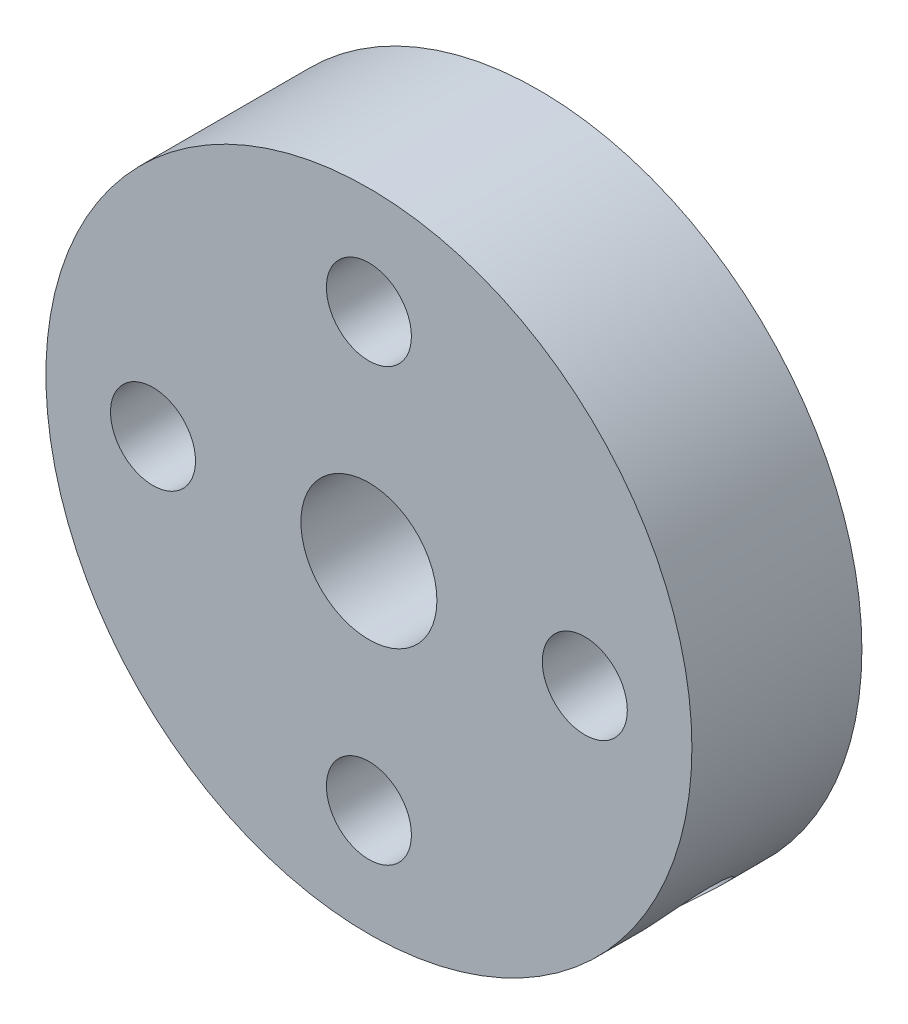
ISO-10303-21;
HEADER;
FILE_DESCRIPTION(('STEP AP214'),'2;1');
FILE_NAME('part.step','',(''),(''),'','','');
FILE_SCHEMA(('AUTOMOTIVE_DESIGN { 1 0 10303 214 1 1 1 1 }'));
ENDSEC;
DATA;
#1=APPLICATION_CONTEXT('core data for automotive mechanical design processes');
#2=APPLICATION_PROTOCOL_DEFINITION('international standard','automotive_design',2000,#1);
#3=PRODUCT_CONTEXT('',#1,'mechanical');
#4=PRODUCT('Part','Part','',(#3));
#5=PRODUCT_RELATED_PRODUCT_CATEGORY('part','',(#4));
#6=PRODUCT_DEFINITION_FORMATION('','',#4);
#7=PRODUCT_DEFINITION_CONTEXT('part definition',#1,'design');
#8=PRODUCT_DEFINITION('design','',#6,#7);
#9=PRODUCT_DEFINITION_SHAPE('','',#8);
#10=(LENGTH_UNIT() NAMED_UNIT(*) SI_UNIT(.MILLI.,.METRE.));
#11=(NAMED_UNIT(*) PLANE_ANGLE_UNIT() SI_UNIT($,.RADIAN.));
#12=(NAMED_UNIT(*) SI_UNIT($,.STERADIAN.) SOLID_ANGLE_UNIT());
#13=UNCERTAINTY_MEASURE_WITH_UNIT(LENGTH_MEASURE(1.E-05),#10,'distance_accuracy_value','');
#14=(GEOMETRIC_REPRESENTATION_CONTEXT(3) GLOBAL_UNCERTAINTY_ASSIGNED_CONTEXT((#13)) GLOBAL_UNIT_ASSIGNED_CONTEXT((#10,
#11,#12)) REPRESENTATION_CONTEXT('',''));
#15=CARTESIAN_POINT('',(0.,0.,0.));
#16=DIRECTION('',(0.,0.,1.));
#17=DIRECTION('',(1.,0.,0.));
#18=AXIS2_PLACEMENT_3D('',#15,#16,#17);
#19=CARTESIAN_POINT('',(0.,0.,5.));
#20=DIRECTION('',(0.,0.,-1.));
#21=DIRECTION('',(-1.,0.,0.));
#22=AXIS2_PLACEMENT_3D('',#19,#20,#21);
#23=CYLINDRICAL_SURFACE('',#22,9.5);
#24=CARTESIAN_POINT('',(7.54299377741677,-5.77522682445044,2.5));
#25=CARTESIAN_POINT('',(7.54299243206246,-5.77522965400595,2.43011379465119));
#26=CARTESIAN_POINT('',(7.53939153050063,-5.77994112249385,2.36018467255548));
#27=CARTESIAN_POINT('',(7.5250384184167,-5.79861450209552,2.22227477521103));
#28=CARTESIAN_POINT('',(7.51427885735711,-5.81258592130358,2.15429607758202));
#29=CARTESIAN_POINT('',(7.4857956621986,-5.84922201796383,2.02230357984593));
#30=CARTESIAN_POINT('',(7.46807690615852,-5.87188060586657,1.95828703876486));
#31=CARTESIAN_POINT('',(7.42598142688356,-5.92502688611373,1.83596492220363));
#32=CARTESIAN_POINT('',(7.40160578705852,-5.95551330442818,1.77765841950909));
#33=CARTESIAN_POINT('',(7.34647045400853,-6.02339512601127,1.66803949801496));
#34=CARTESIAN_POINT('',(7.31567621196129,-6.06082779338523,1.61676752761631));
#35=CARTESIAN_POINT('',(7.24836322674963,-6.14117020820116,1.52302277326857));
#36=CARTESIAN_POINT('',(7.21184419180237,-6.18408023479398,1.48055043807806));
#37=CARTESIAN_POINT('',(7.13368219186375,-6.27408466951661,1.40546437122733));
#38=CARTESIAN_POINT('',(7.09202090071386,-6.32119386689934,1.37288742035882));
#39=CARTESIAN_POINT('',(7.0046262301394,-6.41790106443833,1.31875255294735));
#40=CARTESIAN_POINT('',(6.95889301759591,-6.46749896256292,1.29719418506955));
#41=CARTESIAN_POINT('',(6.86477339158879,-6.56731009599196,1.265829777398));
#42=CARTESIAN_POINT('',(6.81640389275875,-6.61751809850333,1.25595634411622));
#43=CARTESIAN_POINT('',(6.71808236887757,-6.71731154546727,1.2480331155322));
#44=CARTESIAN_POINT('',(6.66813041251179,-6.76689701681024,1.24998280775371));
#45=CARTESIAN_POINT('',(6.56840652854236,-6.86373356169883,1.26559667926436));
#46=CARTESIAN_POINT('',(6.5186353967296,-6.91099717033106,1.27918837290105));
#47=CARTESIAN_POINT('',(6.42047178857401,-7.00228803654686,1.31758700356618));
#48=CARTESIAN_POINT('',(6.37207934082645,-7.04631522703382,1.3423941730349));
#49=CARTESIAN_POINT('',(6.27806077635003,-7.13021308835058,1.40259594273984));
#50=CARTESIAN_POINT('',(6.23244328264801,-7.17007105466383,1.43802170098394));
#51=CARTESIAN_POINT('',(6.14562599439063,-7.24462287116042,1.51843235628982));
#52=CARTESIAN_POINT('',(6.10442642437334,-7.27931645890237,1.56341773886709));
#53=CARTESIAN_POINT('',(6.02755543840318,-7.34309840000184,1.66207612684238));
#54=CARTESIAN_POINT('',(5.99192824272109,-7.37214232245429,1.7158123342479));
#55=CARTESIAN_POINT('',(5.9278600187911,-7.42375737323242,1.83023047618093));
#56=CARTESIAN_POINT('',(5.89941901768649,-7.44632847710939,1.89091243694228));
#57=CARTESIAN_POINT('',(5.85077620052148,-7.48460961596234,2.01755772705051));
#58=CARTESIAN_POINT('',(5.83057852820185,-7.50031620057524,2.0835236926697));
#59=CARTESIAN_POINT('',(5.79923340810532,-7.52457895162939,2.21883386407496));
#60=CARTESIAN_POINT('',(5.78808547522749,-7.53313550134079,2.28817788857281));
#61=CARTESIAN_POINT('',(5.77533482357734,-7.5429154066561,2.42772111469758));
#62=CARTESIAN_POINT('',(5.77366142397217,-7.54419306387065,2.49791005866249));
#63=CARTESIAN_POINT('',(5.77973733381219,-7.53953913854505,2.63763655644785));
#64=CARTESIAN_POINT('',(5.78748642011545,-7.53360772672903,2.70717412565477));
#65=CARTESIAN_POINT('',(5.81205053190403,-7.51467265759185,2.84335692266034));
#66=CARTESIAN_POINT('',(5.82883131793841,-7.50169570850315,2.91001205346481));
#67=CARTESIAN_POINT('',(5.87078766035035,-7.46890600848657,3.03884829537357));
#68=CARTESIAN_POINT('',(5.89596354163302,-7.44909299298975,3.10102923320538));
#69=CARTESIAN_POINT('',(5.95394173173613,-7.40283432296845,3.21955093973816));
#70=CARTESIAN_POINT('',(5.98678770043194,-7.37635062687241,3.27585549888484));
#71=CARTESIAN_POINT('',(6.05883931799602,-7.31728301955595,3.38065603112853));
#72=CARTESIAN_POINT('',(6.09804524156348,-7.28469884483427,3.42915166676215));
#73=CARTESIAN_POINT('',(6.18172359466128,-7.21382788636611,3.51726989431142));
#74=CARTESIAN_POINT('',(6.22622783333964,-7.17550626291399,3.55683429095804));
#75=CARTESIAN_POINT('',(6.31879476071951,-7.0941261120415,3.62556359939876));
#76=CARTESIAN_POINT('',(6.36685737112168,-7.05106768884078,3.65472873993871));
#77=CARTESIAN_POINT('',(6.46482442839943,-6.96135331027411,3.70173630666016));
#78=CARTESIAN_POINT('',(6.51472301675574,-6.91470835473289,3.71961191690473));
#79=CARTESIAN_POINT('',(6.61492982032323,-6.81890793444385,3.74364082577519));
#80=CARTESIAN_POINT('',(6.66523801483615,-6.76975259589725,3.74979471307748));
#81=CARTESIAN_POINT('',(6.76438593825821,-6.67067897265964,3.75019366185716));
#82=CARTESIAN_POINT('',(6.81323388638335,-6.62076925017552,3.7445282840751));
#83=CARTESIAN_POINT('',(6.9085087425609,-6.52129220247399,3.72163976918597));
#84=CARTESIAN_POINT('',(6.95493565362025,-6.47172487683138,3.70441664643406));
#85=CARTESIAN_POINT('',(7.04417102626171,-6.3744812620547,3.65893059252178));
#86=CARTESIAN_POINT('',(7.08698104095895,-6.32680416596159,3.63067242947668));
#87=CARTESIAN_POINT('',(7.16802112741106,-6.234840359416,3.56392774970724));
#88=CARTESIAN_POINT('',(7.20625112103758,-6.1905537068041,3.52544105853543));
#89=CARTESIAN_POINT('',(7.27759335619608,-6.10652925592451,3.43900219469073));
#90=CARTESIAN_POINT('',(7.31066652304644,-6.06682672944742,3.39098348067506));
#91=CARTESIAN_POINT('',(7.37072691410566,-5.99371582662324,3.28698264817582));
#92=CARTESIAN_POINT('',(7.39771269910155,-5.96030893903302,3.23099865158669));
#93=CARTESIAN_POINT('',(7.44520215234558,-5.90088319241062,3.11237952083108));
#94=CARTESIAN_POINT('',(7.46567759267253,-5.87489655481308,3.04971695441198));
#95=CARTESIAN_POINT('',(7.49961241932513,-5.83151599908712,2.91974623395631));
#96=CARTESIAN_POINT('',(7.51307935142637,-5.8141128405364,2.85244316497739));
#97=CARTESIAN_POINT('',(7.52960566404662,-5.79268088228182,2.73733543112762));
#98=CARTESIAN_POINT('',(7.53462161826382,-5.78614791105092,2.69025340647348));
#99=CARTESIAN_POINT('',(7.54131611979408,-5.7774199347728,2.5954542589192));
#100=CARTESIAN_POINT('',(7.54299469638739,-5.77522489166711,2.54773714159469));
#101=CARTESIAN_POINT('',(7.54299377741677,-5.77522682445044,2.5));
#102=B_SPLINE_CURVE_WITH_KNOTS('',3,(#24,#25,#26,#27,#28,#29,#30,#31,#32,#33,#34,#35,#36,#37,
#38,#39,#40,#41,#42,#43,#44,#45,#46,#47,#48,#49,#50,#51,#52,#53,#54,#55,#56,#57,#58,#59,#60,#61,
#62,#63,#64,#65,#66,#67,#68,#69,#70,#71,#72,#73,#74,#75,#76,#77,#78,#79,#80,#81,#82,#83,#84,#85,
#86,#87,#88,#89,#90,#91,#92,#93,#94,#95,#96,#97,#98,#99,#100,#101),.UNSPECIFIED.,.T.,.F.,(4,2,2,
2,2,2,2,2,2,2,2,2,2,2,2,2,2,2,2,2,2,2,2,2,2,2,2,2,2,2,2,2,2,2,2,2,2,2,4),(0.,0.209484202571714,
0.419183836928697,0.628736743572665,0.83825556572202,1.04893269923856,1.25962057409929,
1.47108224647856,1.68253525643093,1.89276266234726,2.10298095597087,2.31189982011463,
2.52082301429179,2.73036535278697,2.93991833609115,3.15105801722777,3.36219849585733,
3.57344497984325,3.78468013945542,3.99433736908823,4.2039896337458,4.41285264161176,
4.62172373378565,4.83181406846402,5.04191347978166,5.25334471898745,5.46477130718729,
5.6755735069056,5.88636511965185,6.09556525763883,6.30476513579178,6.51387472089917,
6.7229878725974,6.93361567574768,7.14429322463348,7.35587216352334,7.56722283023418,
7.71031637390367,7.85340866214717),.UNSPECIFIED.);
#103=CARTESIAN_POINT('',(7.54299377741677,-5.77522682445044,2.5));
#104=VERTEX_POINT('',#103);
#105=EDGE_CURVE('E85',#104,#104,#102,.T.);
#106=ORIENTED_EDGE('',*,*,#105,.T.);
#107=EDGE_LOOP('',(#106));
#108=FACE_BOUND('',#107,.T.);
#109=CARTESIAN_POINT('',(0.,0.,5.));
#110=DIRECTION('',(0.,0.,1.));
#111=DIRECTION('',(1.,0.,0.));
#112=AXIS2_PLACEMENT_3D('',#109,#110,#111);
#113=CIRCLE('',#112,9.5);
#114=CARTESIAN_POINT('',(9.5,0.,5.));
#115=VERTEX_POINT('',#114);
#116=EDGE_CURVE('E10',#115,#115,#113,.T.);
#117=ORIENTED_EDGE('',*,*,#116,.F.);
#118=EDGE_LOOP('',(#117));
#119=FACE_BOUND('',#118,.T.);
#120=CARTESIAN_POINT('',(0.,0.,0.));
#121=DIRECTION('',(0.,0.,1.));
#122=DIRECTION('',(1.,0.,0.));
#123=AXIS2_PLACEMENT_3D('',#120,#121,#122);
#124=CIRCLE('',#123,9.5);
#125=CARTESIAN_POINT('',(9.5,0.,0.));
#126=VERTEX_POINT('',#125);
#127=EDGE_CURVE('E47',#126,#126,#124,.T.);
#128=ORIENTED_EDGE('',*,*,#127,.T.);
#129=EDGE_LOOP('',(#128));
#130=FACE_BOUND('',#129,.T.);
#131=ADVANCED_FACE('F43',(#108,#119,#130),#23,.T.);
#132=CARTESIAN_POINT('',(0.,0.,5.));
#133=DIRECTION('',(0.,0.,1.));
#134=DIRECTION('',(1.,0.,0.));
#135=AXIS2_PLACEMENT_3D('',#132,#133,#134);
#136=PLANE('',#135);
#137=CARTESIAN_POINT('',(6.35,0.,5.));
#138=DIRECTION('',(0.,0.,1.));
#139=DIRECTION('',(1.,0.,0.));
#140=AXIS2_PLACEMENT_3D('',#137,#138,#139);
#141=CIRCLE('',#140,1.25);
#142=CARTESIAN_POINT('',(7.6,0.,5.));
#143=VERTEX_POINT('',#142);
#144=EDGE_CURVE('E82',#143,#143,#141,.T.);
#145=ORIENTED_EDGE('',*,*,#144,.F.);
#146=EDGE_LOOP('',(#145));
#147=FACE_BOUND('',#146,.T.);
#148=CARTESIAN_POINT('',(0.,-6.35,5.));
#149=DIRECTION('',(0.,0.,1.));
#150=DIRECTION('',(1.,0.,0.));
#151=AXIS2_PLACEMENT_3D('',#148,#149,#150);
#152=CIRCLE('',#151,1.25);
#153=CARTESIAN_POINT('',(1.25,-6.35,5.));
#154=VERTEX_POINT('',#153);
#155=EDGE_CURVE('E76',#154,#154,#152,.T.);
#156=ORIENTED_EDGE('',*,*,#155,.F.);
#157=EDGE_LOOP('',(#156));
#158=FACE_BOUND('',#157,.T.);
#159=CARTESIAN_POINT('',(-6.35,0.,5.));
#160=DIRECTION('',(0.,0.,1.));
#161=DIRECTION('',(1.,0.,0.));
#162=AXIS2_PLACEMENT_3D('',#159,#160,#161);
#163=CIRCLE('',#162,1.25);
#164=CARTESIAN_POINT('',(-5.1,0.,5.));
#165=VERTEX_POINT('',#164);
#166=EDGE_CURVE('E70',#165,#165,#163,.T.);
#167=ORIENTED_EDGE('',*,*,#166,.F.);
#168=EDGE_LOOP('',(#167));
#169=FACE_BOUND('',#168,.T.);
#170=CARTESIAN_POINT('',(0.,6.35,5.));
#171=DIRECTION('',(0.,0.,1.));
#172=DIRECTION('',(1.,0.,0.));
#173=AXIS2_PLACEMENT_3D('',#170,#171,#172);
#174=CIRCLE('',#173,1.25);
#175=CARTESIAN_POINT('',(1.25,6.35,5.));
#176=VERTEX_POINT('',#175);
#177=EDGE_CURVE('E64',#176,#176,#174,.T.);
#178=ORIENTED_EDGE('',*,*,#177,.F.);
#179=EDGE_LOOP('',(#178));
#180=FACE_BOUND('',#179,.T.);
#181=CARTESIAN_POINT('',(0.,0.,5.));
#182=DIRECTION('',(0.,0.,1.));
#183=DIRECTION('',(1.,0.,0.));
#184=AXIS2_PLACEMENT_3D('',#181,#182,#183);
#185=CIRCLE('',#184,2.);
#186=CARTESIAN_POINT('',(2.,0.,5.));
#187=VERTEX_POINT('',#186);
#188=EDGE_CURVE('E58',#187,#187,#185,.T.);
#189=ORIENTED_EDGE('',*,*,#188,.F.);
#190=EDGE_LOOP('',(#189));
#191=FACE_BOUND('',#190,.T.);
#192=ORIENTED_EDGE('',*,*,#116,.T.);
#193=EDGE_LOOP('',(#192));
#194=FACE_BOUND('',#193,.T.);
#195=ADVANCED_FACE('F125',(#147,#158,#169,#180,#191,#194),#136,.T.);
#196=CARTESIAN_POINT('',(0.,0.,0.));
#197=DIRECTION('',(0.,0.,1.));
#198=DIRECTION('',(1.,0.,0.));
#199=AXIS2_PLACEMENT_3D('',#196,#197,#198);
#200=PLANE('',#199);
#201=CARTESIAN_POINT('',(6.35,0.,0.));
#202=DIRECTION('',(0.,0.,1.));
#203=DIRECTION('',(1.,0.,0.));
#204=AXIS2_PLACEMENT_3D('',#201,#202,#203);
#205=CIRCLE('',#204,1.25);
#206=CARTESIAN_POINT('',(7.6,0.,0.));
#207=VERTEX_POINT('',#206);
#208=EDGE_CURVE('E79',#207,#207,#205,.T.);
#209=ORIENTED_EDGE('',*,*,#208,.T.);
#210=EDGE_LOOP('',(#209));
#211=FACE_BOUND('',#210,.T.);
#212=CARTESIAN_POINT('',(0.,-6.35,0.));
#213=DIRECTION('',(0.,0.,1.));
#214=DIRECTION('',(1.,0.,0.));
#215=AXIS2_PLACEMENT_3D('',#212,#213,#214);
#216=CIRCLE('',#215,1.25);
#217=CARTESIAN_POINT('',(1.25,-6.35,0.));
#218=VERTEX_POINT('',#217);
#219=EDGE_CURVE('E73',#218,#218,#216,.T.);
#220=ORIENTED_EDGE('',*,*,#219,.T.);
#221=EDGE_LOOP('',(#220));
#222=FACE_BOUND('',#221,.T.);
#223=CARTESIAN_POINT('',(-6.35,0.,0.));
#224=DIRECTION('',(0.,0.,1.));
#225=DIRECTION('',(1.,0.,0.));
#226=AXIS2_PLACEMENT_3D('',#223,#224,#225);
#227=CIRCLE('',#226,1.25);
#228=CARTESIAN_POINT('',(-5.1,0.,0.));
#229=VERTEX_POINT('',#228);
#230=EDGE_CURVE('E67',#229,#229,#227,.T.);
#231=ORIENTED_EDGE('',*,*,#230,.T.);
#232=EDGE_LOOP('',(#231));
#233=FACE_BOUND('',#232,.T.);
#234=CARTESIAN_POINT('',(0.,6.35,0.));
#235=DIRECTION('',(0.,0.,1.));
#236=DIRECTION('',(1.,0.,0.));
#237=AXIS2_PLACEMENT_3D('',#234,#235,#236);
#238=CIRCLE('',#237,1.25);
#239=CARTESIAN_POINT('',(1.25,6.35,0.));
#240=VERTEX_POINT('',#239);
#241=EDGE_CURVE('E61',#240,#240,#238,.T.);
#242=ORIENTED_EDGE('',*,*,#241,.T.);
#243=EDGE_LOOP('',(#242));
#244=FACE_BOUND('',#243,.T.);
#245=CARTESIAN_POINT('',(0.,0.,0.));
#246=DIRECTION('',(0.,0.,1.));
#247=DIRECTION('',(1.,0.,0.));
#248=AXIS2_PLACEMENT_3D('',#245,#246,#247);
#249=CIRCLE('',#248,2.);
#250=CARTESIAN_POINT('',(2.,0.,0.));
#251=VERTEX_POINT('',#250);
#252=EDGE_CURVE('E54',#251,#251,#249,.T.);
#253=ORIENTED_EDGE('',*,*,#252,.T.);
#254=EDGE_LOOP('',(#253));
#255=FACE_BOUND('',#254,.T.);
#256=ORIENTED_EDGE('',*,*,#127,.F.);
#257=EDGE_LOOP('',(#256));
#258=FACE_BOUND('',#257,.T.);
#259=ADVANCED_FACE('F123',(#211,#222,#233,#244,#255,#258),#200,.F.);
#260=CARTESIAN_POINT('',(0.,0.,5.));
#261=DIRECTION('',(0.,0.,1.));
#262=DIRECTION('',(1.,0.,0.));
#263=AXIS2_PLACEMENT_3D('',#260,#261,#262);
#264=CYLINDRICAL_SURFACE('',#263,2.);
#265=CARTESIAN_POINT('',(1.98785358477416,-0.22008663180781,2.5));
#266=CARTESIAN_POINT('',(1.98785579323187,-0.220096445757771,2.56212028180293));
#267=CARTESIAN_POINT('',(1.9872199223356,-0.226061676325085,2.62433783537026));
#268=CARTESIAN_POINT('',(1.98444333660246,-0.249218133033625,2.74667632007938));
#269=CARTESIAN_POINT('',(1.98229853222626,-0.266439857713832,2.80679108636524));
#270=CARTESIAN_POINT('',(1.97592617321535,-0.310151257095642,2.92278232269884));
#271=CARTESIAN_POINT('',(1.97171656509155,-0.336560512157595,2.97869060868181));
#272=CARTESIAN_POINT('',(1.96048817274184,-0.396764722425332,3.08600886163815));
#273=CARTESIAN_POINT('',(1.95346931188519,-0.430559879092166,3.1374187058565));
#274=CARTESIAN_POINT('',(1.93466925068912,-0.508803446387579,3.24186515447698));
#275=CARTESIAN_POINT('',(1.92237548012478,-0.554072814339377,3.29419474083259));
#276=CARTESIAN_POINT('',(1.89210239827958,-0.649986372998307,3.39188269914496));
#277=CARTESIAN_POINT('',(1.87411817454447,-0.700635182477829,3.43723499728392));
#278=CARTESIAN_POINT('',(1.82891839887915,-0.811834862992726,3.52510358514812));
#279=CARTESIAN_POINT('',(1.80085091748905,-0.872843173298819,3.5666176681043));
#280=CARTESIAN_POINT('',(1.73540719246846,-0.996616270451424,3.63812520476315));
#281=CARTESIAN_POINT('',(1.69804022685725,-1.05937925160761,3.66813006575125));
#282=CARTESIAN_POINT('',(1.61819639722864,-1.17727730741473,3.71248231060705));
#283=CARTESIAN_POINT('',(1.57662528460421,-1.2325391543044,3.72811141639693));
#284=CARTESIAN_POINT('',(1.48677017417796,-1.33954332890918,3.74763206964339));
#285=CARTESIAN_POINT('',(1.43849328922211,-1.39128930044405,3.75153595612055));
#286=CARTESIAN_POINT('',(1.3438304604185,-1.48251648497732,3.74764431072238));
#287=CARTESIAN_POINT('',(1.29806029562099,-1.52271168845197,3.74134862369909));
#288=CARTESIAN_POINT('',(1.2043061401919,-1.59789117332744,3.72013301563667));
#289=CARTESIAN_POINT('',(1.15632198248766,-1.63287506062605,3.70521244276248));
#290=CARTESIAN_POINT('',(1.05959400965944,-1.69724751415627,3.66739622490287));
#291=CARTESIAN_POINT('',(1.01084855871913,-1.72662146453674,3.6444801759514));
#292=CARTESIAN_POINT('',(0.914173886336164,-1.77969976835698,3.59153124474));
#293=CARTESIAN_POINT('',(0.866244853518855,-1.80340282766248,3.56149674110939));
#294=CARTESIAN_POINT('',(0.76665841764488,-1.8481266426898,3.49097183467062));
#295=CARTESIAN_POINT('',(0.715279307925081,-1.86844650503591,3.44964537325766));
#296=CARTESIAN_POINT('',(0.616848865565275,-1.90321553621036,3.35986761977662));
#297=CARTESIAN_POINT('',(0.569803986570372,-1.91765605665,3.31140597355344));
#298=CARTESIAN_POINT('',(0.476137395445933,-1.94317814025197,3.20129437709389));
#299=CARTESIAN_POINT('',(0.430373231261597,-1.95357479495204,3.13874861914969));
#300=CARTESIAN_POINT('',(0.349932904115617,-1.96957729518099,3.00635388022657));
#301=CARTESIAN_POINT('',(0.31523633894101,-1.9751919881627,2.93651865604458));
#302=CARTESIAN_POINT('',(0.267804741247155,-1.98209415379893,2.81023059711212));
#303=CARTESIAN_POINT('',(0.251693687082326,-1.98413134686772,2.75508903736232));
#304=CARTESIAN_POINT('',(0.228883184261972,-1.98689444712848,2.64288481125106));
#305=CARTESIAN_POINT('',(0.222170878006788,-1.98762214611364,2.5858248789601));
#306=CARTESIAN_POINT('',(0.218832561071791,-1.98799302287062,2.47127131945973));
#307=CARTESIAN_POINT('',(0.222229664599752,-1.98763371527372,2.41377699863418));
#308=CARTESIAN_POINT('',(0.238792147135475,-1.9857098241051,2.3002194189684));
#309=CARTESIAN_POINT('',(0.2519656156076,-1.98414424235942,2.24415738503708));
#310=CARTESIAN_POINT('',(0.286555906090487,-1.97943934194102,2.13578161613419));
#311=CARTESIAN_POINT('',(0.307833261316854,-1.97632639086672,2.08342132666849));
#312=CARTESIAN_POINT('',(0.357181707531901,-1.96800563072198,1.98221266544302));
#313=CARTESIAN_POINT('',(0.385255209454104,-1.96279707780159,1.9333655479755));
#314=CARTESIAN_POINT('',(0.452702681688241,-1.94845098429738,1.83069396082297));
#315=CARTESIAN_POINT('',(0.493210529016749,-1.93875420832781,1.77769245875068));
#316=CARTESIAN_POINT('',(0.580003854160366,-1.9145834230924,1.67781494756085));
#317=CARTESIAN_POINT('',(0.626295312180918,-1.90010444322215,1.63094538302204));
#318=CARTESIAN_POINT('',(0.730760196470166,-1.86266938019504,1.53701675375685));
#319=CARTESIAN_POINT('',(0.789648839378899,-1.83872653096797,1.49113144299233));
#320=CARTESIAN_POINT('',(0.910430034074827,-1.78200983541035,1.40993134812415));
#321=CARTESIAN_POINT('',(0.972321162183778,-1.74924014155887,1.37461161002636));
#322=CARTESIAN_POINT('',(1.09259782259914,-1.67656323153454,1.31800500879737));
#323=CARTESIAN_POINT('',(1.15097186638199,-1.63719945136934,1.29600579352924));
#324=CARTESIAN_POINT('',(1.26516188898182,-1.5506364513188,1.26427333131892));
#325=CARTESIAN_POINT('',(1.32098130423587,-1.50344817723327,1.25452311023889));
#326=CARTESIAN_POINT('',(1.41956348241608,-1.41023098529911,1.24845347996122));
#327=CARTESIAN_POINT('',(1.4630373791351,-1.36505882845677,1.25036422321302));
#328=CARTESIAN_POINT('',(1.5449485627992,-1.27160963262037,1.26346167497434));
#329=CARTESIAN_POINT('',(1.58338607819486,-1.22333273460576,1.27464796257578));
#330=CARTESIAN_POINT('',(1.6532187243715,-1.12707005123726,1.3051604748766));
#331=CARTESIAN_POINT('',(1.68481191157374,-1.07913227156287,1.32419083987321));
#332=CARTESIAN_POINT('',(1.74242711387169,-0.983398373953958,1.36955992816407));
#333=CARTESIAN_POINT('',(1.76844818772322,-0.935602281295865,1.3958998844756));
#334=CARTESIAN_POINT('',(1.8175544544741,-0.836575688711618,1.45816057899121));
#335=CARTESIAN_POINT('',(1.84005458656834,-0.785503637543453,1.49479198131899));
#336=CARTESIAN_POINT('',(1.87917375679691,-0.686685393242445,1.57507663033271));
#337=CARTESIAN_POINT('',(1.89578609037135,-0.638943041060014,1.61873780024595));
#338=CARTESIAN_POINT('',(1.92596636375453,-0.541842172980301,1.71911626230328));
#339=CARTESIAN_POINT('',(1.93875033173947,-0.493242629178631,1.77680834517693));
#340=CARTESIAN_POINT('',(1.95905451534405,-0.405154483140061,1.89964466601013));
#341=CARTESIAN_POINT('',(1.96657764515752,-0.365660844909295,1.96478475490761));
#342=CARTESIAN_POINT('',(1.97656771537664,-0.306394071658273,2.08640276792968));
#343=CARTESIAN_POINT('',(1.97978271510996,-0.28419416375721,2.14163568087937));
#344=CARTESIAN_POINT('',(1.98450918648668,-0.249087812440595,2.2549692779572));
#345=CARTESIAN_POINT('',(1.98602605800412,-0.236151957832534,2.31306025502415));
#346=CARTESIAN_POINT('',(1.9872271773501,-0.225684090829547,2.39303052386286));
#347=CARTESIAN_POINT('',(1.98746319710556,-0.223589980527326,2.414364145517));
#348=CARTESIAN_POINT('',(1.98777603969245,-0.220789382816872,2.45712796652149));
#349=CARTESIAN_POINT('',(1.98785282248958,-0.220083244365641,2.47855818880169));
#350=CARTESIAN_POINT('',(1.98785358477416,-0.22008663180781,2.5));
#351=B_SPLINE_CURVE_WITH_KNOTS('',3,(#265,#266,#267,#268,#269,#270,#271,#272,#273,#274,#275,
#276,#277,#278,#279,#280,#281,#282,#283,#284,#285,#286,#287,#288,#289,#290,#291,#292,#293,#294,
#295,#296,#297,#298,#299,#300,#301,#302,#303,#304,#305,#306,#307,#308,#309,#310,#311,#312,#313,
#314,#315,#316,#317,#318,#319,#320,#321,#322,#323,#324,#325,#326,#327,#328,#329,#330,#331,#332,
#333,#334,#335,#336,#337,#338,#339,#340,#341,#342,#343,#344,#345,#346,#347,#348,#349,#350),
.UNSPECIFIED.,.T.,.F.,(4,2,2,2,2,2,2,2,2,2,2,2,2,2,2,2,2,2,2,2,2,2,2,2,2,2,2,2,2,2,2,2,2,2,2,2,
2,2,2,2,2,2,4),(0.,0.186262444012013,0.373031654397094,0.558205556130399,0.743384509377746,
0.953406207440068,1.16360970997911,1.39917236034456,1.63450092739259,1.84590412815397,
2.05708478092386,2.2399231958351,2.42277543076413,2.60609774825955,2.7894618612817,
2.99564504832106,3.20213044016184,3.43558067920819,3.66859805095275,3.84032775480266,
4.01182230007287,4.18370925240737,4.35573859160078,4.52493212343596,4.69418576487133,
4.89566333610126,5.09735098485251,5.33136598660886,5.56527109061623,5.78520080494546,
6.00482541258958,6.1920360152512,6.37923812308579,6.5599456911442,6.74068376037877,
6.94018144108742,7.13990556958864,7.36841817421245,7.59680409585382,7.77496902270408,
7.95256577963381,8.01684109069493,8.08113255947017),.UNSPECIFIED.);
#352=CARTESIAN_POINT('',(1.98785358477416,-0.22008663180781,2.5));
#353=VERTEX_POINT('',#352);
#354=EDGE_CURVE('E92',#353,#353,#351,.T.);
#355=ORIENTED_EDGE('',*,*,#354,.T.);
#356=EDGE_LOOP('',(#355));
#357=FACE_BOUND('',#356,.T.);
#358=ORIENTED_EDGE('',*,*,#252,.F.);
#359=EDGE_LOOP('',(#358));
#360=FACE_BOUND('',#359,.T.);
#361=ORIENTED_EDGE('',*,*,#188,.T.);
#362=EDGE_LOOP('',(#361));
#363=FACE_BOUND('',#362,.T.);
#364=ADVANCED_FACE('F119',(#357,#360,#363),#264,.F.);
#365=CARTESIAN_POINT('',(0.,6.35,5.));
#366=DIRECTION('',(0.,0.,1.));
#367=DIRECTION('',(1.,0.,0.));
#368=AXIS2_PLACEMENT_3D('',#365,#366,#367);
#369=CYLINDRICAL_SURFACE('',#368,1.25);
#370=ORIENTED_EDGE('',*,*,#241,.F.);
#371=EDGE_LOOP('',(#370));
#372=FACE_BOUND('',#371,.T.);
#373=ORIENTED_EDGE('',*,*,#177,.T.);
#374=EDGE_LOOP('',(#373));
#375=FACE_BOUND('',#374,.T.);
#376=ADVANCED_FACE('F115',(#372,#375),#369,.F.);
#377=CARTESIAN_POINT('',(-6.35,0.,5.));
#378=DIRECTION('',(0.,0.,1.));
#379=DIRECTION('',(1.,0.,0.));
#380=AXIS2_PLACEMENT_3D('',#377,#378,#379);
#381=CYLINDRICAL_SURFACE('',#380,1.25);
#382=ORIENTED_EDGE('',*,*,#230,.F.);
#383=EDGE_LOOP('',(#382));
#384=FACE_BOUND('',#383,.T.);
#385=ORIENTED_EDGE('',*,*,#166,.T.);
#386=EDGE_LOOP('',(#385));
#387=FACE_BOUND('',#386,.T.);
#388=ADVANCED_FACE('F111',(#384,#387),#381,.F.);
#389=CARTESIAN_POINT('',(0.,-6.35,5.));
#390=DIRECTION('',(0.,0.,1.));
#391=DIRECTION('',(1.,0.,0.));
#392=AXIS2_PLACEMENT_3D('',#389,#390,#391);
#393=CYLINDRICAL_SURFACE('',#392,1.25);
#394=ORIENTED_EDGE('',*,*,#219,.F.);
#395=EDGE_LOOP('',(#394));
#396=FACE_BOUND('',#395,.T.);
#397=ORIENTED_EDGE('',*,*,#155,.T.);
#398=EDGE_LOOP('',(#397));
#399=FACE_BOUND('',#398,.T.);
#400=ADVANCED_FACE('F107',(#396,#399),#393,.F.);
#401=CARTESIAN_POINT('',(6.35,0.,5.));
#402=DIRECTION('',(0.,0.,1.));
#403=DIRECTION('',(1.,0.,0.));
#404=AXIS2_PLACEMENT_3D('',#401,#402,#403);
#405=CYLINDRICAL_SURFACE('',#404,1.25);
#406=ORIENTED_EDGE('',*,*,#208,.F.);
#407=EDGE_LOOP('',(#406));
#408=FACE_BOUND('',#407,.T.);
#409=ORIENTED_EDGE('',*,*,#144,.T.);
#410=EDGE_LOOP('',(#409));
#411=FACE_BOUND('',#410,.T.);
#412=ADVANCED_FACE('F100',(#408,#411),#405,.F.);
#413=CARTESIAN_POINT('',(6.71751442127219,-6.71751442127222,2.5));
#414=DIRECTION('',(0.707106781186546,-0.707106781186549,0.));
#415=DIRECTION('',(0.707106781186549,0.707106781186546,0.));
#416=AXIS2_PLACEMENT_3D('',#413,#414,#415);
#417=CYLINDRICAL_SURFACE('',#416,1.24999999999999);
#418=ORIENTED_EDGE('',*,*,#354,.F.);
#419=EDGE_LOOP('',(#418));
#420=FACE_BOUND('',#419,.T.);
#421=ORIENTED_EDGE('',*,*,#105,.F.);
#422=EDGE_LOOP('',(#421));
#423=FACE_BOUND('',#422,.T.);
#424=ADVANCED_FACE('F97',(#420,#423),#417,.F.);
#425=CLOSED_SHELL('',(#131,#195,#259,#364,#376,#388,#400,#412,#424));
#426=MANIFOLD_SOLID_BREP('B2',#425);
#427=ADVANCED_BREP_SHAPE_REPRESENTATION('',(#18,#426),#14);
#428=SHAPE_DEFINITION_REPRESENTATION(#9,#427);
ENDSEC;
END-ISO-10303-21;
